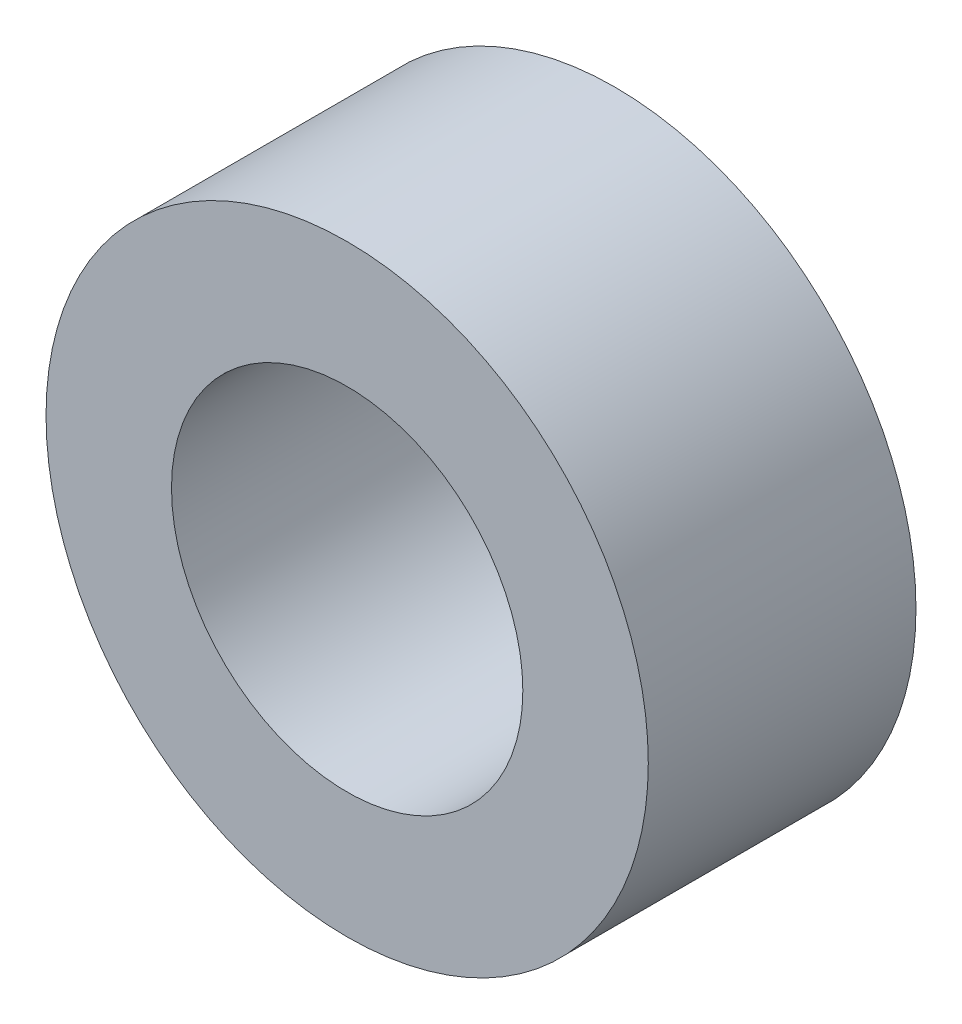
ISO-10303-21;
HEADER;
FILE_DESCRIPTION(('STEP AP214'),'2;1');
FILE_NAME('part.step','',(''),(''),'','','');
FILE_SCHEMA(('AUTOMOTIVE_DESIGN { 1 0 10303 214 1 1 1 1 }'));
ENDSEC;
DATA;
#1=APPLICATION_CONTEXT('core data for automotive mechanical design processes');
#2=APPLICATION_PROTOCOL_DEFINITION('international standard','automotive_design',2000,#1);
#3=PRODUCT_CONTEXT('',#1,'mechanical');
#4=PRODUCT('Part','Part','',(#3));
#5=PRODUCT_RELATED_PRODUCT_CATEGORY('part','',(#4));
#6=PRODUCT_DEFINITION_FORMATION('','',#4);
#7=PRODUCT_DEFINITION_CONTEXT('part definition',#1,'design');
#8=PRODUCT_DEFINITION('design','',#6,#7);
#9=PRODUCT_DEFINITION_SHAPE('','',#8);
#10=(LENGTH_UNIT() NAMED_UNIT(*) SI_UNIT(.MILLI.,.METRE.));
#11=(NAMED_UNIT(*) PLANE_ANGLE_UNIT() SI_UNIT($,.RADIAN.));
#12=(NAMED_UNIT(*) SI_UNIT($,.STERADIAN.) SOLID_ANGLE_UNIT());
#13=UNCERTAINTY_MEASURE_WITH_UNIT(LENGTH_MEASURE(1.E-05),#10,'distance_accuracy_value','');
#14=(GEOMETRIC_REPRESENTATION_CONTEXT(3) GLOBAL_UNCERTAINTY_ASSIGNED_CONTEXT((#13)) GLOBAL_UNIT_ASSIGNED_CONTEXT((#10,
#11,#12)) REPRESENTATION_CONTEXT('',''));
#15=CARTESIAN_POINT('',(0.,0.,0.));
#16=DIRECTION('',(0.,0.,1.));
#17=DIRECTION('',(1.,0.,0.));
#18=AXIS2_PLACEMENT_3D('',#15,#16,#17);
#19=CARTESIAN_POINT('',(0.,0.,16.));
#20=DIRECTION('',(0.,0.,1.));
#21=DIRECTION('',(1.,0.,0.));
#22=AXIS2_PLACEMENT_3D('',#19,#20,#21);
#23=PLANE('',#22);
#24=CARTESIAN_POINT('',(0.,0.,16.));
#25=DIRECTION('',(0.,0.,1.));
#26=DIRECTION('',(1.,0.,0.));
#27=AXIS2_PLACEMENT_3D('',#24,#25,#26);
#28=CIRCLE('',#27,10.5);
#29=CARTESIAN_POINT('',(10.5,0.,16.));
#30=VERTEX_POINT('',#29);
#31=EDGE_CURVE('E24',#30,#30,#28,.T.);
#32=ORIENTED_EDGE('',*,*,#31,.F.);
#33=EDGE_LOOP('',(#32));
#34=FACE_BOUND('',#33,.T.);
#35=CARTESIAN_POINT('',(0.,0.,16.));
#36=DIRECTION('',(0.,0.,1.));
#37=DIRECTION('',(1.,0.,0.));
#38=AXIS2_PLACEMENT_3D('',#35,#36,#37);
#39=CIRCLE('',#38,18.);
#40=CARTESIAN_POINT('',(18.,0.,16.));
#41=VERTEX_POINT('',#40);
#42=EDGE_CURVE('E57',#41,#41,#39,.T.);
#43=ORIENTED_EDGE('',*,*,#42,.T.);
#44=EDGE_LOOP('',(#43));
#45=FACE_BOUND('',#44,.T.);
#46=ADVANCED_FACE('F16',(#34,#45),#23,.T.);
#47=CARTESIAN_POINT('',(0.,0.,0.));
#48=DIRECTION('',(0.,0.,1.));
#49=DIRECTION('',(1.,0.,0.));
#50=AXIS2_PLACEMENT_3D('',#47,#48,#49);
#51=PLANE('',#50);
#52=CARTESIAN_POINT('',(0.,0.,0.));
#53=DIRECTION('',(0.,0.,1.));
#54=DIRECTION('',(1.,0.,0.));
#55=AXIS2_PLACEMENT_3D('',#52,#53,#54);
#56=CIRCLE('',#55,10.5);
#57=CARTESIAN_POINT('',(10.5,0.,0.));
#58=VERTEX_POINT('',#57);
#59=EDGE_CURVE('E10',#58,#58,#56,.T.);
#60=ORIENTED_EDGE('',*,*,#59,.T.);
#61=EDGE_LOOP('',(#60));
#62=FACE_BOUND('',#61,.T.);
#63=CARTESIAN_POINT('',(0.,0.,0.));
#64=DIRECTION('',(0.,0.,1.));
#65=DIRECTION('',(1.,0.,0.));
#66=AXIS2_PLACEMENT_3D('',#63,#64,#65);
#67=CIRCLE('',#66,18.);
#68=CARTESIAN_POINT('',(18.,0.,0.));
#69=VERTEX_POINT('',#68);
#70=EDGE_CURVE('E56',#69,#69,#67,.T.);
#71=ORIENTED_EDGE('',*,*,#70,.F.);
#72=EDGE_LOOP('',(#71));
#73=FACE_BOUND('',#72,.T.);
#74=ADVANCED_FACE('F88',(#62,#73),#51,.F.);
#75=CARTESIAN_POINT('',(0.,0.,0.));
#76=DIRECTION('',(0.,0.,-1.));
#77=DIRECTION('',(1.,0.,0.));
#78=AXIS2_PLACEMENT_3D('',#75,#76,#77);
#79=CYLINDRICAL_SURFACE('',#78,10.5);
#80=DIRECTION('',(0.,0.,1.));
#81=VECTOR('',#80,1.);
#82=CARTESIAN_POINT('',(10.5,0.,0.));
#83=LINE('',#82,#81);
#84=EDGE_CURVE('E63',#58,#30,#83,.T.);
#85=ORIENTED_EDGE('',*,*,#84,.T.);
#86=ORIENTED_EDGE('',*,*,#31,.T.);
#87=ORIENTED_EDGE('',*,*,#84,.F.);
#88=ORIENTED_EDGE('',*,*,#59,.F.);
#89=EDGE_LOOP('',(#85,#86,#87,#88));
#90=FACE_BOUND('',#89,.T.);
#91=ADVANCED_FACE('F79',(#90),#79,.F.);
#92=CARTESIAN_POINT('',(0.,0.,0.));
#93=DIRECTION('',(0.,0.,-1.));
#94=DIRECTION('',(1.,0.,0.));
#95=AXIS2_PLACEMENT_3D('',#92,#93,#94);
#96=CYLINDRICAL_SURFACE('',#95,18.);
#97=ORIENTED_EDGE('',*,*,#70,.T.);
#98=DIRECTION('',(0.,0.,1.));
#99=VECTOR('',#98,1.);
#100=CARTESIAN_POINT('',(18.,0.,0.));
#101=LINE('',#100,#99);
#102=EDGE_CURVE('E53',#69,#41,#101,.T.);
#103=ORIENTED_EDGE('',*,*,#102,.T.);
#104=ORIENTED_EDGE('',*,*,#42,.F.);
#105=ORIENTED_EDGE('',*,*,#102,.F.);
#106=EDGE_LOOP('',(#97,#103,#104,#105));
#107=FACE_BOUND('',#106,.T.);
#108=ADVANCED_FACE('F54',(#107),#96,.T.);
#109=CLOSED_SHELL('',(#46,#74,#91,#108));
#110=MANIFOLD_SOLID_BREP('B1',#109);
#111=ADVANCED_BREP_SHAPE_REPRESENTATION('',(#18,#110),#14);
#112=SHAPE_DEFINITION_REPRESENTATION(#9,#111);
ENDSEC;
END-ISO-10303-21;
